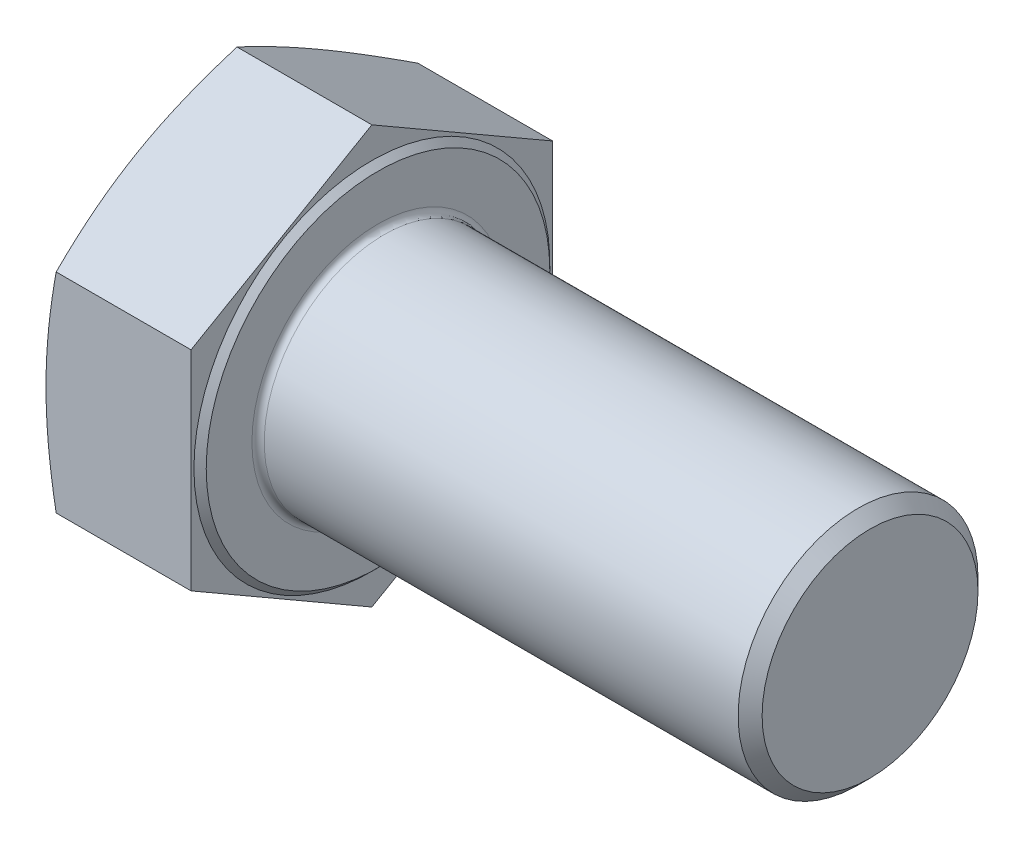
from build123d import *

# Parameters (mm, degrees)
BASEHEAD_DEPTH = 24.58
SKETCH5_R      = 19.5
BASEBODY_DEPTH = 80
CHAMFER1_SIZE  = 1.95
HEADFILLET_R   = 1


with BuildPart() as part:
    # Sketch2 → BaseHead (new body)
    with BuildSketch(Plane(origin=(0, 0, 0), x_dir=(0, 0, -1), z_dir=(1, 0, 0))):
        Polygon((29.4, -16.974097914), (29.4, 16.974097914), (0, 33.948195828), (-29.4, 16.974097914), (-29.4, -16.974097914), (0, -33.948195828), align=None)
    extrude(amount=BASEHEAD_DEPTH)

    # Sketch3 → BearingFace (revolve, cut)
    with BuildSketch(Plane.XY, mode=Mode.PRIVATE) as bearingface_sk:
        Polygon((24.58, 33.948195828), (24.58, 27.93), (23.58, 28.93), (23.58, 33.948195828), align=None)
    revolve(bearingface_sk.sketch.rotate(Axis((-0.957090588, 0, 0), (1, 0, 0)), 90), axis=Axis((-0.957090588, 0, 0), (1, 0, 0)), mode=Mode.SUBTRACT)

    # Sketch4 → HeadChamfer (revolve, cut)
    with BuildSketch(Plane.XY):
        Polygon((0, 33.948195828), (1.655407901, 33.948195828), (0, 29.4), align=None)
    revolve(axis=Axis((-0.493528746, 0, 0), (1, 0, 0)), mode=Mode.SUBTRACT)

    # Sketch5 → BaseBody (add)
    with BuildSketch(Plane(origin=(24.58, 0, 0), x_dir=(0, 0, -1), z_dir=(1, 0, 0))):
        Circle(SKETCH5_R)
    extrude(amount=BASEBODY_DEPTH)

    # Chamfer1
    chamfer1_edges = [part.edges().sort_by_distance(p)[0] for p in [
        (104.58, 0, 19.5),
    ]]
    chamfer(chamfer1_edges, length=CHAMFER1_SIZE)

    # HeadFillet
    headfillet_edges = [part.edges().sort_by_distance(p)[0] for p in [
        (24.58, 0, 19.5),
    ]]
    fillet(headfillet_edges, radius=HEADFILLET_R)


solid = part.part
